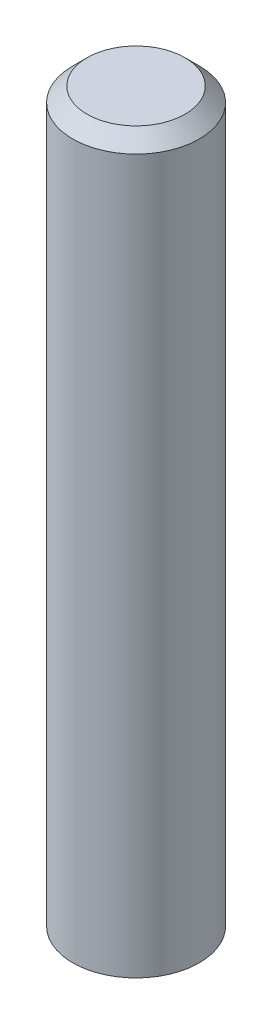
ISO-10303-21;
HEADER;
FILE_DESCRIPTION(('STEP AP214'),'2;1');
FILE_NAME('part.step','',(''),(''),'','','');
FILE_SCHEMA(('AUTOMOTIVE_DESIGN { 1 0 10303 214 1 1 1 1 }'));
ENDSEC;
DATA;
#1=APPLICATION_CONTEXT('core data for automotive mechanical design processes');
#2=APPLICATION_PROTOCOL_DEFINITION('international standard','automotive_design',2000,#1);
#3=PRODUCT_CONTEXT('',#1,'mechanical');
#4=PRODUCT('Part','Part','',(#3));
#5=PRODUCT_RELATED_PRODUCT_CATEGORY('part','',(#4));
#6=PRODUCT_DEFINITION_FORMATION('','',#4);
#7=PRODUCT_DEFINITION_CONTEXT('part definition',#1,'design');
#8=PRODUCT_DEFINITION('design','',#6,#7);
#9=PRODUCT_DEFINITION_SHAPE('','',#8);
#10=(LENGTH_UNIT() NAMED_UNIT(*) SI_UNIT(.MILLI.,.METRE.));
#11=(NAMED_UNIT(*) PLANE_ANGLE_UNIT() SI_UNIT($,.RADIAN.));
#12=(NAMED_UNIT(*) SI_UNIT($,.STERADIAN.) SOLID_ANGLE_UNIT());
#13=UNCERTAINTY_MEASURE_WITH_UNIT(LENGTH_MEASURE(1.E-05),#10,'distance_accuracy_value','');
#14=(GEOMETRIC_REPRESENTATION_CONTEXT(3) GLOBAL_UNCERTAINTY_ASSIGNED_CONTEXT((#13)) GLOBAL_UNIT_ASSIGNED_CONTEXT((#10,
#11,#12)) REPRESENTATION_CONTEXT('',''));
#15=CARTESIAN_POINT('',(0.,0.,0.));
#16=DIRECTION('',(0.,0.,1.));
#17=DIRECTION('',(1.,0.,0.));
#18=AXIS2_PLACEMENT_3D('',#15,#16,#17);
#19=CARTESIAN_POINT('',(0.,1.,0.));
#20=DIRECTION('',(0.,-1.,0.));
#21=DIRECTION('',(0.,0.,-1.));
#22=AXIS2_PLACEMENT_3D('',#19,#20,#21);
#23=PLANE('',#22);
#24=DIRECTION('',(0.867162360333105,0.,-0.498025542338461));
#25=VECTOR('',#24,1.);
#26=CARTESIAN_POINT('',(0.599209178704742,1.,0.347776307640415));
#27=LINE('',#26,#25);
#28=CARTESIAN_POINT('',(0.599209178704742,1.,0.347776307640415));
#29=VERTEX_POINT('',#28);
#30=CARTESIAN_POINT('',(-0.00157852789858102,1.,0.692818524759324));
#31=VERTEX_POINT('',#30);
#32=EDGE_CURVE('E90',#29,#31,#27,.F.);
#33=ORIENTED_EDGE('',*,*,#32,.T.);
#34=DIRECTION('',(0.864883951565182,0.,0.501971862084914));
#35=VECTOR('',#34,1.);
#36=CARTESIAN_POINT('',(-0.00157852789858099,1.,0.692818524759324));
#37=LINE('',#36,#35);
#38=CARTESIAN_POINT('',(-0.600787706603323,1.,0.345042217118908));
#39=VERTEX_POINT('',#38);
#40=EDGE_CURVE('E97',#31,#39,#37,.F.);
#41=ORIENTED_EDGE('',*,*,#40,.T.);
#42=DIRECTION('',(-0.00227840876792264,0.,0.999997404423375));
#43=VECTOR('',#42,1.);
#44=CARTESIAN_POINT('',(-0.600787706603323,1.,0.345042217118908));
#45=LINE('',#44,#43);
#46=CARTESIAN_POINT('',(-0.599209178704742,1.,-0.347776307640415));
#47=VERTEX_POINT('',#46);
#48=EDGE_CURVE('E102',#39,#47,#45,.F.);
#49=ORIENTED_EDGE('',*,*,#48,.T.);
#50=DIRECTION('',(-0.867162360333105,0.,0.498025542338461));
#51=VECTOR('',#50,1.);
#52=CARTESIAN_POINT('',(-0.599209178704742,1.,-0.347776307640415));
#53=LINE('',#52,#51);
#54=CARTESIAN_POINT('',(0.00157852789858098,1.,-0.692818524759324));
#55=VERTEX_POINT('',#54);
#56=EDGE_CURVE('E73',#47,#55,#53,.F.);
#57=ORIENTED_EDGE('',*,*,#56,.T.);
#58=DIRECTION('',(-0.864883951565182,0.,-0.501971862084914));
#59=VECTOR('',#58,1.);
#60=CARTESIAN_POINT('',(0.00157852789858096,1.,-0.692818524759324));
#61=LINE('',#60,#59);
#62=CARTESIAN_POINT('',(0.600787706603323,1.,-0.345042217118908));
#63=VERTEX_POINT('',#62);
#64=EDGE_CURVE('E70',#55,#63,#61,.F.);
#65=ORIENTED_EDGE('',*,*,#64,.T.);
#66=DIRECTION('',(0.0022784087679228,0.,-0.999997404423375));
#67=VECTOR('',#66,1.);
#68=CARTESIAN_POINT('',(0.600787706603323,1.,-0.345042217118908));
#69=LINE('',#68,#67);
#70=EDGE_CURVE('E67',#63,#29,#69,.F.);
#71=ORIENTED_EDGE('',*,*,#70,.T.);
#72=EDGE_LOOP('',(#33,#41,#49,#57,#65,#71));
#73=FACE_BOUND('',#72,.T.);
#74=ADVANCED_FACE('F17',(#73),#23,.T.);
#75=CARTESIAN_POINT('',(0.,11.5,0.));
#76=DIRECTION('',(0.,1.,0.));
#77=DIRECTION('',(0.,0.,1.));
#78=AXIS2_PLACEMENT_3D('',#75,#76,#77);
#79=PLANE('',#78);
#80=CARTESIAN_POINT('',(0.,11.5000000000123,0.));
#81=DIRECTION('',(0.,-1.,0.));
#82=DIRECTION('',(0.,0.,-1.));
#83=AXIS2_PLACEMENT_3D('',#80,#81,#82);
#84=CIRCLE('',#83,0.773999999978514);
#85=CARTESIAN_POINT('',(0.,11.5000000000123,-0.773999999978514));
#86=VERTEX_POINT('',#85);
#87=EDGE_CURVE('E20',#86,#86,#84,.T.);
#88=ORIENTED_EDGE('',*,*,#87,.F.);
#89=EDGE_LOOP('',(#88));
#90=FACE_BOUND('',#89,.T.);
#91=ADVANCED_FACE('F166',(#90),#79,.T.);
#92=CARTESIAN_POINT('',(0.00157852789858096,1.,-0.692818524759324));
#93=DIRECTION('',(0.501971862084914,0.,-0.864883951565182));
#94=DIRECTION('',(-0.864883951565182,0.,-0.501971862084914));
#95=AXIS2_PLACEMENT_3D('',#92,#93,#94);
#96=PLANE('',#95);
#97=DIRECTION('',(0.,1.,0.));
#98=VECTOR('',#97,1.);
#99=CARTESIAN_POINT('',(0.600787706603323,1.,-0.345042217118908));
#100=LINE('',#99,#98);
#101=CARTESIAN_POINT('',(0.600787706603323,0.,-0.345042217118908));
#102=VERTEX_POINT('',#101);
#103=EDGE_CURVE('E76',#102,#63,#100,.T.);
#104=ORIENTED_EDGE('',*,*,#103,.T.);
#105=ORIENTED_EDGE('',*,*,#64,.F.);
#106=DIRECTION('',(0.,1.,0.));
#107=VECTOR('',#106,1.);
#108=CARTESIAN_POINT('',(0.00157852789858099,1.,-0.692818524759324));
#109=LINE('',#108,#107);
#110=CARTESIAN_POINT('',(0.00157852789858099,0.,-0.692818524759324));
#111=VERTEX_POINT('',#110);
#112=EDGE_CURVE('E107',#55,#111,#109,.F.);
#113=ORIENTED_EDGE('',*,*,#112,.T.);
#114=DIRECTION('',(0.864883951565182,0.,0.501971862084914));
#115=VECTOR('',#114,1.);
#116=CARTESIAN_POINT('',(0.00157852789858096,0.,-0.692818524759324));
#117=LINE('',#116,#115);
#118=EDGE_CURVE('E81',#111,#102,#117,.T.);
#119=ORIENTED_EDGE('',*,*,#118,.T.);
#120=EDGE_LOOP('',(#104,#105,#113,#119));
#121=FACE_BOUND('',#120,.T.);
#122=ADVANCED_FACE('F79',(#121),#96,.F.);
#123=CARTESIAN_POINT('',(0.600787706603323,1.,-0.345042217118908));
#124=DIRECTION('',(0.999997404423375,0.,0.0022784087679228));
#125=DIRECTION('',(0.0022784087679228,0.,-0.999997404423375));
#126=AXIS2_PLACEMENT_3D('',#123,#124,#125);
#127=PLANE('',#126);
#128=DIRECTION('',(0.,1.,0.));
#129=VECTOR('',#128,1.);
#130=CARTESIAN_POINT('',(0.599209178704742,1.,0.347776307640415));
#131=LINE('',#130,#129);
#132=CARTESIAN_POINT('',(0.599209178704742,0.,0.347776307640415));
#133=VERTEX_POINT('',#132);
#134=EDGE_CURVE('E87',#133,#29,#131,.T.);
#135=ORIENTED_EDGE('',*,*,#134,.T.);
#136=ORIENTED_EDGE('',*,*,#70,.F.);
#137=ORIENTED_EDGE('',*,*,#103,.F.);
#138=DIRECTION('',(-0.00227840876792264,0.,0.999997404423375));
#139=VECTOR('',#138,1.);
#140=CARTESIAN_POINT('',(0.600787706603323,0.,-0.345042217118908));
#141=LINE('',#140,#139);
#142=EDGE_CURVE('E113',#102,#133,#141,.T.);
#143=ORIENTED_EDGE('',*,*,#142,.T.);
#144=EDGE_LOOP('',(#135,#136,#137,#143));
#145=FACE_BOUND('',#144,.T.);
#146=ADVANCED_FACE('F85',(#145),#127,.F.);
#147=CARTESIAN_POINT('',(0.599209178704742,1.,0.347776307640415));
#148=DIRECTION('',(0.498025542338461,0.,0.867162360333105));
#149=DIRECTION('',(0.867162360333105,0.,-0.498025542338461));
#150=AXIS2_PLACEMENT_3D('',#147,#148,#149);
#151=PLANE('',#150);
#152=DIRECTION('',(0.,1.,0.));
#153=VECTOR('',#152,1.);
#154=CARTESIAN_POINT('',(-0.00157852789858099,1.,0.692818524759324));
#155=LINE('',#154,#153);
#156=CARTESIAN_POINT('',(-0.00157852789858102,0.,0.692818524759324));
#157=VERTEX_POINT('',#156);
#158=EDGE_CURVE('E94',#157,#31,#155,.T.);
#159=ORIENTED_EDGE('',*,*,#158,.T.);
#160=ORIENTED_EDGE('',*,*,#32,.F.);
#161=ORIENTED_EDGE('',*,*,#134,.F.);
#162=DIRECTION('',(-0.867162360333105,0.,0.498025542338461));
#163=VECTOR('',#162,1.);
#164=CARTESIAN_POINT('',(0.599209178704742,0.,0.347776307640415));
#165=LINE('',#164,#163);
#166=EDGE_CURVE('E115',#133,#157,#165,.T.);
#167=ORIENTED_EDGE('',*,*,#166,.T.);
#168=EDGE_LOOP('',(#159,#160,#161,#167));
#169=FACE_BOUND('',#168,.T.);
#170=ADVANCED_FACE('F129',(#169),#151,.F.);
#171=CARTESIAN_POINT('',(-0.00157852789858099,1.,0.692818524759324));
#172=DIRECTION('',(-0.501971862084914,0.,0.864883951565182));
#173=DIRECTION('',(0.864883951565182,0.,0.501971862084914));
#174=AXIS2_PLACEMENT_3D('',#171,#172,#173);
#175=PLANE('',#174);
#176=DIRECTION('',(0.,1.,0.));
#177=VECTOR('',#176,1.);
#178=CARTESIAN_POINT('',(-0.600787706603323,1.,0.345042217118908));
#179=LINE('',#178,#177);
#180=CARTESIAN_POINT('',(-0.600787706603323,0.,0.345042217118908));
#181=VERTEX_POINT('',#180);
#182=EDGE_CURVE('E99',#181,#39,#179,.T.);
#183=ORIENTED_EDGE('',*,*,#182,.T.);
#184=ORIENTED_EDGE('',*,*,#40,.F.);
#185=ORIENTED_EDGE('',*,*,#158,.F.);
#186=DIRECTION('',(-0.864883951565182,0.,-0.501971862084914));
#187=VECTOR('',#186,1.);
#188=CARTESIAN_POINT('',(-0.00157852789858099,0.,0.692818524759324));
#189=LINE('',#188,#187);
#190=EDGE_CURVE('E117',#157,#181,#189,.T.);
#191=ORIENTED_EDGE('',*,*,#190,.T.);
#192=EDGE_LOOP('',(#183,#184,#185,#191));
#193=FACE_BOUND('',#192,.T.);
#194=ADVANCED_FACE('F134',(#193),#175,.F.);
#195=CARTESIAN_POINT('',(-0.600787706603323,1.,0.345042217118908));
#196=DIRECTION('',(-0.999997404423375,0.,-0.00227840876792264));
#197=DIRECTION('',(-0.00227840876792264,0.,0.999997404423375));
#198=AXIS2_PLACEMENT_3D('',#195,#196,#197);
#199=PLANE('',#198);
#200=DIRECTION('',(0.,1.,0.));
#201=VECTOR('',#200,1.);
#202=CARTESIAN_POINT('',(-0.599209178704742,1.,-0.347776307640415));
#203=LINE('',#202,#201);
#204=CARTESIAN_POINT('',(-0.599209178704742,0.,-0.347776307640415));
#205=VERTEX_POINT('',#204);
#206=EDGE_CURVE('E104',#205,#47,#203,.T.);
#207=ORIENTED_EDGE('',*,*,#206,.T.);
#208=ORIENTED_EDGE('',*,*,#48,.F.);
#209=ORIENTED_EDGE('',*,*,#182,.F.);
#210=DIRECTION('',(0.00227840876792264,0.,-0.999997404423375));
#211=VECTOR('',#210,1.);
#212=CARTESIAN_POINT('',(-0.600787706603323,0.,0.345042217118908));
#213=LINE('',#212,#211);
#214=EDGE_CURVE('E34',#181,#205,#213,.T.);
#215=ORIENTED_EDGE('',*,*,#214,.T.);
#216=EDGE_LOOP('',(#207,#208,#209,#215));
#217=FACE_BOUND('',#216,.T.);
#218=ADVANCED_FACE('F135',(#217),#199,.F.);
#219=CARTESIAN_POINT('',(-0.599209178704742,1.,-0.347776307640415));
#220=DIRECTION('',(-0.498025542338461,0.,-0.867162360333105));
#221=DIRECTION('',(-0.867162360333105,0.,0.498025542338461));
#222=AXIS2_PLACEMENT_3D('',#219,#220,#221);
#223=PLANE('',#222);
#224=ORIENTED_EDGE('',*,*,#112,.F.);
#225=ORIENTED_EDGE('',*,*,#56,.F.);
#226=ORIENTED_EDGE('',*,*,#206,.F.);
#227=DIRECTION('',(0.867162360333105,0.,-0.498025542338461));
#228=VECTOR('',#227,1.);
#229=CARTESIAN_POINT('',(-0.599209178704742,0.,-0.347776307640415));
#230=LINE('',#229,#228);
#231=EDGE_CURVE('E111',#205,#111,#230,.T.);
#232=ORIENTED_EDGE('',*,*,#231,.T.);
#233=EDGE_LOOP('',(#224,#225,#226,#232));
#234=FACE_BOUND('',#233,.T.);
#235=ADVANCED_FACE('F123',(#234),#223,.F.);
#236=CARTESIAN_POINT('',(0.,11.2740000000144,0.));
#237=DIRECTION('',(0.,-1.,0.));
#238=DIRECTION('',(0.,0.,-1.));
#239=AXIS2_PLACEMENT_3D('',#236,#237,#238);
#240=CONICAL_SURFACE('',#239,0.999999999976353,0.785398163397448);
#241=CARTESIAN_POINT('',(0.,11.274,0.));
#242=DIRECTION('',(0.,-1.,0.));
#243=DIRECTION('',(0.,0.,-1.));
#244=AXIS2_PLACEMENT_3D('',#241,#242,#243);
#245=CIRCLE('',#244,0.999999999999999);
#246=CARTESIAN_POINT('',(0.,11.274,-0.999999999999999));
#247=VERTEX_POINT('',#246);
#248=EDGE_CURVE('E26',#247,#247,#245,.T.);
#249=ORIENTED_EDGE('',*,*,#248,.F.);
#250=EDGE_LOOP('',(#249));
#251=FACE_BOUND('',#250,.T.);
#252=ORIENTED_EDGE('',*,*,#87,.T.);
#253=EDGE_LOOP('',(#252));
#254=FACE_BOUND('',#253,.T.);
#255=ADVANCED_FACE('F143',(#251,#254),#240,.T.);
#256=CARTESIAN_POINT('',(0.,0.,0.));
#257=DIRECTION('',(0.,1.,0.));
#258=DIRECTION('',(0.,0.,1.));
#259=AXIS2_PLACEMENT_3D('',#256,#257,#258);
#260=PLANE('',#259);
#261=CARTESIAN_POINT('',(0.,0.,0.));
#262=DIRECTION('',(0.,-1.,0.));
#263=DIRECTION('',(0.,0.,-1.));
#264=AXIS2_PLACEMENT_3D('',#261,#262,#263);
#265=CIRCLE('',#264,0.999999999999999);
#266=CARTESIAN_POINT('',(0.,0.,-0.999999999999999));
#267=VERTEX_POINT('',#266);
#268=EDGE_CURVE('E11',#267,#267,#265,.F.);
#269=ORIENTED_EDGE('',*,*,#268,.F.);
#270=EDGE_LOOP('',(#269));
#271=FACE_BOUND('',#270,.T.);
#272=ORIENTED_EDGE('',*,*,#214,.F.);
#273=ORIENTED_EDGE('',*,*,#190,.F.);
#274=ORIENTED_EDGE('',*,*,#166,.F.);
#275=ORIENTED_EDGE('',*,*,#142,.F.);
#276=ORIENTED_EDGE('',*,*,#118,.F.);
#277=ORIENTED_EDGE('',*,*,#231,.F.);
#278=EDGE_LOOP('',(#272,#273,#274,#275,#276,#277));
#279=FACE_BOUND('',#278,.T.);
#280=ADVANCED_FACE('F125',(#271,#279),#260,.F.);
#281=CARTESIAN_POINT('',(0.,11.5,0.));
#282=DIRECTION('',(0.,-1.,0.));
#283=DIRECTION('',(0.,0.,-1.));
#284=AXIS2_PLACEMENT_3D('',#281,#282,#283);
#285=CYLINDRICAL_SURFACE('',#284,0.999999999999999);
#286=ORIENTED_EDGE('',*,*,#268,.T.);
#287=EDGE_LOOP('',(#286));
#288=FACE_BOUND('',#287,.T.);
#289=ORIENTED_EDGE('',*,*,#248,.T.);
#290=EDGE_LOOP('',(#289));
#291=FACE_BOUND('',#290,.T.);
#292=ADVANCED_FACE('F146',(#288,#291),#285,.T.);
#293=CLOSED_SHELL('',(#74,#91,#122,#146,#170,#194,#218,#235,#255,#280,#292));
#294=MANIFOLD_SOLID_BREP('B1',#293);
#295=ADVANCED_BREP_SHAPE_REPRESENTATION('',(#18,#294),#14);
#296=SHAPE_DEFINITION_REPRESENTATION(#9,#295);
ENDSEC;
END-ISO-10303-21;
